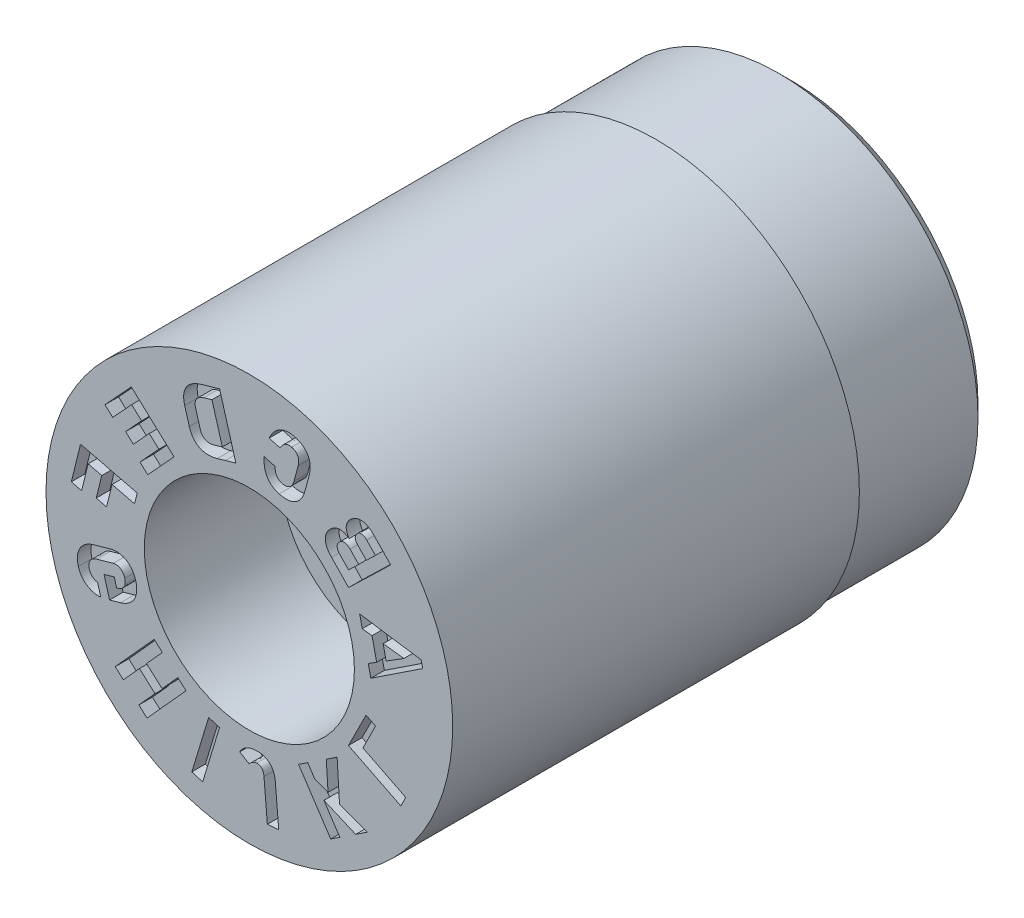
from build123d import *

# Parameters (mm, degrees)
SKETCH4_W          = 2
SKETCH4_H          = 1
CUT_EXTRUDE1_DEPTH = 0.2


with BuildPart() as part:
    # Sketch1 → Revolve1 (revolve)
    with BuildSketch(Plane(origin=(0, 0, 0), x_dir=(0, 0, -1), z_dir=(1, 0, 0)), mode=Mode.PRIVATE) as revolve1_sk:
        Polygon((0, 3), (0, 1.55), (2, 1.55), (2, 0.8), (8, 0.8), (8, 2.75), (7.75, 3), align=None)
    revolve(revolve1_sk.sketch.rotate(Axis((0, 0, 3.797909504), (0, 0, -1)), 90), axis=Axis((0, 0, 3.797909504), (0, 0, -1)))

    # Sketch4 → Cut-Revolve1 (revolve, cut)
    with BuildSketch(Plane(origin=(0, 0, 0), x_dir=(0, 0, -1), z_dir=(1, 0, 0)), mode=Mode.PRIVATE) as cut_revolve1_sk:
        with Locations((7, 3.435)):
            Rectangle(SKETCH4_W, SKETCH4_H)
    revolve(cut_revolve1_sk.sketch.rotate(Axis((0, 0, 0), (0, 0, -1)), 90), axis=Axis((0, 0, 0), (0, 0, -1)), mode=Mode.SUBTRACT)

    # Sketch6 → Cut-Extrude1 (cut)
    # profile 1 of 12: a face of its own
    with BuildSketch(Plane.XY):
        Polygon((2.557112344, 0.51714167), (2.534916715, 0.617228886), (1.627700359, 0.750865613), (1.665534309, 0.581287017), (1.810054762, 0.564113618), (1.878092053, 0.258007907), (1.754401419, 0.181171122), (1.792235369, 0.011592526), align=None)
        Polygon((2.280805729, 0.508174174), (2.018025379, 0.344934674), (1.973629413, 0.544676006), align=None, mode=Mode.SUBTRACT)
    # profile 2 of 12: a face of its own
    with BuildSketch(Plane.XY):
        Polygon((-1.476295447, 1.504463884), (-1.334967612, 1.374509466), (-1.614146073, 1.0709373), (-1.499633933, 0.965694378), (-1.111407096, 1.387815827), (-1.741630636, 1.967321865), (-1.850705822, 1.848743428), (-2.129857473, 1.545200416), (-2.015345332, 1.439957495), (-1.736220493, 1.743471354), (-1.590510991, 1.609487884), (-1.825724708, 1.353724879), (-1.711576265, 1.248627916), align=None)
    # profile 3 of 12: a face of its own
    with BuildSketch(Plane.XY):
        with BuildLine():
            Line((2.085140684, 1.606120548), (1.84036894, 1.859096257))
            add(Edge.make_bspline(
                [(1.84036894, 1.859096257), (1.822115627, 1.877570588), (1.793983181, 1.903334), (1.752110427, 1.929038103), (1.721596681, 1.94324822), (1.691045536, 1.952879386), (1.660522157, 1.957798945), (1.630160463, 1.957469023), (1.60009621, 1.95273834), (1.570694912, 1.943008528), (1.531321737, 1.923647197), (1.504926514, 1.90246375), (1.488476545, 1.886526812)],
                knots=[0, 0, 0, 0, 0.194855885, 0.283381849, 0.366878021, 0.446236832, 0.522449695, 0.597295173, 0.672599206, 0.749380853, 0.828228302, 1, 1, 1, 1], degree=3))
            add(Edge.make_bspline(
                [(1.488476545, 1.886526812), (1.476812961, 1.87557192), (1.461822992, 1.85735973), (1.445963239, 1.830827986), (1.437628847, 1.810324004), (1.43190925, 1.789319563), (1.42906479, 1.76788841), (1.429081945, 1.74602974), (1.4318005, 1.723818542), (1.437672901, 1.701403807), (1.449441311, 1.670760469), (1.461959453, 1.64885337), (1.471649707, 1.634755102)],
                knots=[0, 0, 0, 0, 0.172429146, 0.253445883, 0.332899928, 0.410642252, 0.487984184, 0.565626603, 0.646115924, 0.728966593, 0.815207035, 1, 1, 1, 1], degree=3))
            add(Edge.make_bspline(
                [(1.471649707, 1.634755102), (1.457377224, 1.64593563), (1.434951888, 1.660705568), (1.402779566, 1.674306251), (1.378996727, 1.681184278), (1.355186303, 1.684834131), (1.331493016, 1.685312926), (1.308034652, 1.682573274), (1.284937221, 1.676585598), (1.262202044, 1.667683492), (1.231997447, 1.651000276), (1.211478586, 1.634221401), (1.198520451, 1.62179725)],
                knots=[0, 0, 0, 0, 0.180056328, 0.264446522, 0.345697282, 0.425065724, 0.502740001, 0.58011963, 0.658619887, 0.738834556, 0.821734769, 1, 1, 1, 1], degree=3))
            Line((1.198520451, 1.62179725), (1.197071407, 1.620443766))
            add(Edge.make_bspline(
                [(1.197071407, 1.620443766), (1.18035078, 1.604488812), (1.158351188, 1.578401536), (1.137260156, 1.539486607), (1.126629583, 1.510113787), (1.120894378, 1.480131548), (1.119572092, 1.449645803), (1.123426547, 1.418830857), (1.132015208, 1.387755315), (1.145281, 1.35673308), (1.170156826, 1.314305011), (1.194312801, 1.284877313), (1.212524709, 1.266212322)],
                knots=[0, 0, 0, 0, 0.172258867, 0.251867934, 0.328670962, 0.404017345, 0.478442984, 0.555079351, 0.634372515, 0.717906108, 0.805699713, 1, 1, 1, 1], degree=3))
            Line((1.212524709, 1.266212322), (1.464408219, 1.005804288))
            Line((1.464408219, 1.005804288), (2.085140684, 1.606120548))
        make_face()
        with BuildLine():
            Line((1.613470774, 1.376362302), (1.464056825, 1.231862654))
            Line((1.464056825, 1.231862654), (1.335989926, 1.364238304))
            add(Edge.make_bspline(
                [(1.335989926, 1.364238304), (1.324418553, 1.376190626), (1.309462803, 1.395409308), (1.297994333, 1.424192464), (1.294449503, 1.444836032), (1.295877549, 1.465149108), (1.304266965, 1.492218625), (1.317896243, 1.509551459), (1.328489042, 1.519689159)],
                knots=[0, 0, 0, 0, 0.283532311, 0.406676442, 0.52306497, 0.636270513, 0.749423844, 1, 1, 1, 1], degree=3))
            Line((1.328489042, 1.519689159), (1.329762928, 1.521048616))
            add(Edge.make_bspline(
                [(1.329762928, 1.521048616), (1.337197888, 1.52792447), (1.348696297, 1.537677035), (1.366264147, 1.54593485), (1.379230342, 1.550186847), (1.392434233, 1.552463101), (1.405864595, 1.55221917), (1.419423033, 1.550272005), (1.432970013, 1.54577908), (1.446502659, 1.539462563), (1.465042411, 1.528232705), (1.477338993, 1.516771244), (1.485414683, 1.50872678)],
                knots=[0, 0, 0, 0, 0.172390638, 0.251587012, 0.327309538, 0.402967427, 0.477182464, 0.553868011, 0.634034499, 0.717811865, 0.806397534, 1, 1, 1, 1], degree=3))
            Line((1.485414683, 1.50872678), (1.613470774, 1.376362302))
        make_face(mode=Mode.SUBTRACT)
        with BuildLine():
            Line((1.726088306, 1.485275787), (1.598028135, 1.617644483))
            add(Edge.make_bspline(
                [(1.598028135, 1.617644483), (1.587549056, 1.628495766), (1.574173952, 1.646029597), (1.56400449, 1.672313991), (1.561401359, 1.69137971), (1.563288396, 1.710175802), (1.572025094, 1.73528461), (1.584643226, 1.751600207), (1.594681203, 1.761204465)],
                knots=[0, 0, 0, 0, 0.278252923, 0.399240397, 0.514829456, 0.629035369, 0.743645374, 1, 1, 1, 1], degree=3))
            add(Edge.make_bspline(
                [(1.594681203, 1.761204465), (1.603710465, 1.76987571), (1.619088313, 1.781099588), (1.642880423, 1.786858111), (1.660777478, 1.787212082), (1.678882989, 1.782984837), (1.704386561, 1.77184997), (1.72072342, 1.757078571), (1.731314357, 1.746549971)],
                knots=[0, 0, 0, 0, 0.243286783, 0.354451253, 0.467149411, 0.585039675, 0.70982128, 1, 1, 1, 1], degree=3))
            Line((1.731314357, 1.746549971), (1.859376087, 1.614179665))
            Line((1.859376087, 1.614179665), (1.726088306, 1.485275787))
        make_face(mode=Mode.SUBTRACT)
    # profile 4 of 12: a face of its own
    with BuildSketch(Plane.XY):
        Polygon((-2.025516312, 0.578984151), (-1.693769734, 0.496948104), (-1.654878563, 0.654467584), (-2.49068516, 0.861150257), (-2.626484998, 0.31213847), (-2.474819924, 0.274537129), (-2.378019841, 0.666153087), (-2.177409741, 0.616545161), (-2.258503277, 0.288122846), (-2.106601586, 0.250595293), align=None)
    # profile 5 of 12: a face of its own
    with BuildSketch(Plane.XY):
        Polygon((-1.392079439, -1.777476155), (-1.629894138, -2.040707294), (-1.509832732, -2.149183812), (-0.934198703, -1.512028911), (-1.054260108, -1.403552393), (-1.287519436, -1.661741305), (-1.516312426, -1.45502202), (-1.283118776, -1.196905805), (-1.403180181, -1.088429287), (-1.978814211, -1.725584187), (-1.858752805, -1.834060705), (-1.620872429, -1.57075687), align=None)
    # profile 6 of 12: a face of its own
    with BuildSketch(Plane.XY):
        Polygon((1.160925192, -1.762472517), (0.963728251, -1.687531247), (0.861137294, -1.532446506), (0.726032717, -1.621860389), (1.200156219, -2.338583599), (1.335260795, -2.249169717), (1.100421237, -1.894167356), (1.568886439, -2.094597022), (1.738921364, -1.982129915), (1.330163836, -1.826788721), (1.294974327, -1.245475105), (1.134745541, -1.351444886), align=None)
    # profile 7 of 12: a face of its own
    with BuildSketch(Plane.XY):
        with BuildLine():
            Line((0.821134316, 1.919204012), (0.88202364, 2.146496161))
            add(Edge.make_bspline(
                [(0.88202364, 2.146496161), (0.886135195, 2.162276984), (0.891532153, 2.18573875), (0.895605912, 2.21698057), (0.897748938, 2.239338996), (0.898067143, 2.261132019), (0.897382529, 2.282376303), (0.895156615, 2.302970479), (0.891584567, 2.322975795), (0.886852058, 2.342289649), (0.880647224, 2.360858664), (0.873385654, 2.378761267), (0.864477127, 2.395711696), (0.85459312, 2.412091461), (0.843379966, 2.427616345), (0.830844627, 2.442375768), (0.817142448, 2.456352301), (0.802084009, 2.469439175), (0.786022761, 2.481767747), (0.768721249, 2.493150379), (0.750263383, 2.503566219), (0.730608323, 2.513072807), (0.702380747, 2.524565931), (0.680319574, 2.531832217), (0.665115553, 2.535833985)],
                knots=[0, 0, 0, 0, 0.096646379, 0.142265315, 0.186536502, 0.22958617, 0.27124953, 0.312357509, 0.352139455, 0.391535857, 0.430009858, 0.468003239, 0.505818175, 0.543289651, 0.581231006, 0.619098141, 0.657880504, 0.697033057, 0.737159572, 0.777713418, 0.819580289, 0.862596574, 0.906929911, 1, 1, 1, 1], degree=3))
            add(Edge.make_bspline(
                [(0.665115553, 2.535833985), (0.640270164, 2.542449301), (0.602551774, 2.548476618), (0.552436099, 2.54661362), (0.516613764, 2.540208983), (0.481890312, 2.529657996), (0.448899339, 2.514004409), (0.417397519, 2.49412714), (0.387920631, 2.469354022), (0.360133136, 2.440655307), (0.325548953, 2.395080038), (0.304083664, 2.356693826), (0.29186229, 2.329274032)],
                knots=[0, 0, 0, 0, 0.164608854, 0.24240016, 0.31989715, 0.396879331, 0.473937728, 0.552866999, 0.634604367, 0.719746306, 0.807992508, 1, 1, 1, 1], degree=3))
            Line((0.29186229, 2.329274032), (0.453705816, 2.286103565))
            add(Edge.make_bspline(
                [(0.453705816, 2.286103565), (0.459909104, 2.298318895), (0.470551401, 2.315372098), (0.487108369, 2.335672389), (0.500201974, 2.348488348), (0.513897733, 2.359611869), (0.528171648, 2.368770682), (0.543143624, 2.375708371), (0.558447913, 2.380941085), (0.574239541, 2.383997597), (0.596089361, 2.385360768), (0.61251644, 2.382549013), (0.62331651, 2.379876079)],
                knots=[0, 0, 0, 0, 0.194869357, 0.285089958, 0.372238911, 0.455159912, 0.535866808, 0.612909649, 0.689488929, 0.765520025, 0.841163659, 1, 1, 1, 1], degree=3))
            add(Edge.make_bspline(
                [(0.62331651, 2.379876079), (0.636954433, 2.376348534), (0.656355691, 2.368938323), (0.679044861, 2.354579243), (0.6933228, 2.342296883), (0.705193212, 2.328278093), (0.714907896, 2.312744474), (0.721892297, 2.295414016), (0.726644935, 2.276705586), (0.728917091, 2.256548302), (0.728203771, 2.227141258), (0.724516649, 2.204665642), (0.720180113, 2.189666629)],
                knots=[0, 0, 0, 0, 0.174354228, 0.254683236, 0.331247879, 0.406480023, 0.481199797, 0.556971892, 0.636726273, 0.719433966, 0.807137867, 1, 1, 1, 1], degree=3))
            Line((0.720180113, 2.189666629), (0.65929079, 1.96237448))
            add(Edge.make_bspline(
                [(0.65929079, 1.96237448), (0.655487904, 1.94727109), (0.64753634, 1.926049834), (0.633547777, 1.9002716), (0.621596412, 1.884092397), (0.60817968, 1.870284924), (0.593359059, 1.859062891), (0.577278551, 1.850318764), (0.560027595, 1.844130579), (0.541570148, 1.840618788), (0.514754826, 1.839835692), (0.494274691, 1.842953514), (0.480679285, 1.846682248)],
                knots=[0, 0, 0, 0, 0.19300086, 0.280017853, 0.363208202, 0.441814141, 0.518167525, 0.593026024, 0.668129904, 0.744727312, 0.825193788, 1, 1, 1, 1], degree=3))
            add(Edge.make_bspline(
                [(0.480679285, 1.846682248), (0.46977792, 1.849626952), (0.454027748, 1.855702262), (0.435326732, 1.86755666), (0.422908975, 1.877995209), (0.41201972, 1.889975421), (0.402547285, 1.903415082), (0.394714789, 1.918392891), (0.388392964, 1.934778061), (0.383856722, 1.952566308), (0.379630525, 1.978554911), (0.379746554, 1.998894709), (0.380566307, 2.01266634)],
                knots=[0, 0, 0, 0, 0.159979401, 0.236987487, 0.312610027, 0.38900691, 0.465622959, 0.544808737, 0.627755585, 0.713748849, 0.804319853, 1, 1, 1, 1], degree=3))
            Line((0.380566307, 2.01266634), (0.218722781, 2.055836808))
            add(Edge.make_bspline(
                [(0.218722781, 2.055836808), (0.216403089, 2.026041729), (0.215239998, 1.981967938), (0.223090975, 1.925305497), (0.232452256, 1.886434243), (0.245783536, 1.850458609), (0.262882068, 1.817446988), (0.283669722, 1.787501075), (0.308107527, 1.760746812), (0.336133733, 1.737574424), (0.378345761, 1.710623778), (0.414197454, 1.697201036), (0.438944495, 1.690484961)],
                knots=[0, 0, 0, 0, 0.191703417, 0.28077236, 0.365725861, 0.447316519, 0.525893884, 0.603227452, 0.68014984, 0.757230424, 0.83550786, 1, 1, 1, 1], degree=3))
            add(Edge.make_bspline(
                [(0.438944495, 1.690484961), (0.45416482, 1.686636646), (0.476827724, 1.681379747), (0.507018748, 1.677331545), (0.528742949, 1.675831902), (0.549923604, 1.675507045), (0.570571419, 1.676781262), (0.59071502, 1.679092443), (0.610202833, 1.683084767), (0.62905573, 1.688408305), (0.647240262, 1.694951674), (0.664763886, 1.702728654), (0.681558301, 1.711828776), (0.697531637, 1.722355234), (0.712855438, 1.734053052), (0.727408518, 1.74711987), (0.741367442, 1.761350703), (0.754293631, 1.776983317), (0.766679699, 1.793605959), (0.777777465, 1.811758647), (0.788239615, 1.830912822), (0.797923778, 1.851206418), (0.809760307, 1.88041826), (0.816988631, 1.903403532), (0.821134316, 1.919204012)],
                knots=[0, 0, 0, 0, 0.093040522, 0.137573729, 0.180288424, 0.221965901, 0.262948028, 0.302742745, 0.341969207, 0.380633, 0.418692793, 0.456346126, 0.494091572, 0.531697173, 0.569548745, 0.608176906, 0.647455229, 0.687506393, 0.728242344, 0.770136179, 0.813403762, 0.857486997, 0.903244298, 1, 1, 1, 1], degree=3))
        make_face()
    # profile 8 of 12: a face of its own
    with BuildSketch(Plane.XY):
        with BuildLine():
            Line((-0.438909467, 2.593617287), (-0.712910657, 2.514290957))
            add(Edge.make_bspline(
                [(-0.712910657, 2.514290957), (-0.729634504, 2.509545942), (-0.753869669, 2.501178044), (-0.784916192, 2.488407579), (-0.806444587, 2.478112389), (-0.826686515, 2.466985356), (-0.845651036, 2.455023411), (-0.863301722, 2.442108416), (-0.879835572, 2.428668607), (-0.89487983, 2.414270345), (-0.908738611, 2.399323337), (-0.921186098, 2.383635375), (-0.931993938, 2.367097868), (-0.941563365, 2.350023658), (-0.949926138, 2.332311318), (-0.956750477, 2.313827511), (-0.961998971, 2.294617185), (-0.966068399, 2.274908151), (-0.968783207, 2.254643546), (-0.969556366, 2.233874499), (-0.969513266, 2.212595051), (-0.967730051, 2.190815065), (-0.963203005, 2.160607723), (-0.957860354, 2.137928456), (-0.953507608, 2.122756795)],
                knots=[0, 0, 0, 0, 0.099745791, 0.147048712, 0.192637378, 0.236649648, 0.279574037, 0.321243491, 0.362131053, 0.401788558, 0.440671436, 0.479065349, 0.516588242, 0.55395045, 0.591347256, 0.628907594, 0.666895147, 0.70555323, 0.744368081, 0.784093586, 0.824759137, 0.866460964, 0.909397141, 1, 1, 1, 1], degree=3))
            Line((-0.953507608, 2.122756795), (-0.88555943, 1.888017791))
            add(Edge.make_bspline(
                [(-0.88555943, 1.888017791), (-0.881232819, 1.873600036), (-0.874298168, 1.852374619), (-0.86205511, 1.825736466), (-0.852367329, 1.806948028), (-0.841533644, 1.789348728), (-0.830034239, 1.772562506), (-0.817226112, 1.757129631), (-0.80368406, 1.742535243), (-0.789221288, 1.729136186), (-0.77379643, 1.717003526), (-0.757580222, 1.706091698), (-0.740431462, 1.696519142), (-0.722434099, 1.688179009), (-0.703571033, 1.680928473), (-0.6837069, 1.675360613), (-0.663130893, 1.670656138), (-0.641745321, 1.667390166), (-0.619609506, 1.66562621), (-0.596762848, 1.665351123), (-0.573260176, 1.666588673), (-0.549020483, 1.669236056), (-0.515126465, 1.674639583), (-0.48966971, 1.68114963), (-0.472553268, 1.685910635)],
                knots=[0, 0, 0, 0, 0.086653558, 0.128037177, 0.168492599, 0.208142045, 0.246814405, 0.285402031, 0.323355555, 0.361249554, 0.398651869, 0.436106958, 0.473537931, 0.511467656, 0.550103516, 0.589610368, 0.62999598, 0.671430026, 0.713895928, 0.757599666, 0.802730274, 0.849157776, 0.897771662, 1, 1, 1, 1], degree=3))
            Line((-0.472553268, 1.685910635), (-0.355309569, 1.71992876))
            Line((-0.355309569, 1.71992876), (-0.19909005, 1.765103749))
            Line((-0.19909005, 1.765103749), (-0.438909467, 2.593617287))
        make_face()
        with BuildLine():
            Line((-0.398850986, 1.870353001), (-0.520193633, 1.835181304))
            add(Edge.make_bspline(
                [(-0.520193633, 1.835181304), (-0.532269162, 1.831402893), (-0.550429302, 1.827718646), (-0.574270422, 1.824987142), (-0.590947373, 1.824383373), (-0.606819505, 1.825610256), (-0.622007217, 1.82803323), (-0.636440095, 1.832048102), (-0.650098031, 1.837494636), (-0.662803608, 1.844443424), (-0.674571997, 1.852702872), (-0.685196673, 1.862359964), (-0.69486693, 1.873278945), (-0.703424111, 1.88559686), (-0.713858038, 1.904190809), (-0.719177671, 1.919720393), (-0.72250945, 1.930277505)],
                knots=[0, 0, 0, 0, 0.149232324, 0.218367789, 0.28334483, 0.346008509, 0.40612766, 0.464758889, 0.522600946, 0.579442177, 0.635447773, 0.692041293, 0.748655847, 0.807380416, 0.868897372, 1, 1, 1, 1], degree=3))
            Line((-0.72250945, 1.930277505), (-0.793112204, 2.174122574))
            add(Edge.make_bspline(
                [(-0.793112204, 2.174122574), (-0.796259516, 2.184812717), (-0.799581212, 2.200891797), (-0.800953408, 2.222220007), (-0.800292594, 2.237276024), (-0.797925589, 2.251748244), (-0.794053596, 2.265617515), (-0.788668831, 2.278979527), (-0.781444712, 2.29156451), (-0.772778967, 2.303487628), (-0.762721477, 2.314622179), (-0.751357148, 2.324973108), (-0.738454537, 2.334356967), (-0.724060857, 2.342750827), (-0.702451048, 2.353256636), (-0.685017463, 2.359477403), (-0.672856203, 2.36291343)],
                knots=[0, 0, 0, 0, 0.13139485, 0.192752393, 0.251615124, 0.30870985, 0.365291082, 0.421108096, 0.478123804, 0.535945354, 0.594614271, 0.654753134, 0.716890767, 0.782367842, 0.850987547, 1, 1, 1, 1], degree=3))
            Line((-0.672856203, 2.36291343), (-0.551599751, 2.398060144))
            Line((-0.551599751, 2.398060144), (-0.398850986, 1.870353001))
        make_face(mode=Mode.SUBTRACT)
    # profile 9 of 12: a face of its own
    with BuildSketch(Plane.XY):
        with BuildLine():
            Line((-2.062339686, -0.916002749), (-1.900497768, -0.870180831))
            add(Edge.make_bspline(
                [(-1.900497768, -0.870180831), (-1.885511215, -0.866100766), (-1.863728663, -0.858525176), (-1.835987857, -0.84634204), (-1.816280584, -0.836628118), (-1.797881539, -0.825517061), (-1.780274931, -0.813697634), (-1.76377663, -0.800839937), (-1.748406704, -0.786977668), (-1.734123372, -0.77235605), (-1.720875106, -0.757110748), (-1.709266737, -0.74088918), (-1.698547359, -0.724270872), (-1.689408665, -0.706765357), (-1.681328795, -0.688607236), (-1.674820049, -0.669654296), (-1.669220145, -0.650182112), (-1.66522439, -0.630195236), (-1.662354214, -0.609829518), (-1.661321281, -0.589108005), (-1.661166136, -0.568062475), (-1.662908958, -0.546703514), (-1.6668542, -0.517400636), (-1.671461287, -0.495381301), (-1.675873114, -0.480861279)],
                knots=[0, 0, 0, 0, 0.091968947, 0.136358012, 0.179438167, 0.222009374, 0.263572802, 0.30499914, 0.345794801, 0.386082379, 0.426029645, 0.465295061, 0.504143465, 0.54307809, 0.582146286, 0.621762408, 0.661685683, 0.702080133, 0.742401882, 0.783396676, 0.824885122, 0.866985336, 0.910204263, 1, 1, 1, 1], degree=3))
            add(Edge.make_bspline(
                [(-1.675873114, -0.480861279), (-1.679950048, -0.466185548), (-1.687312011, -0.444837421), (-1.699125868, -0.417572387), (-1.708715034, -0.398263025), (-1.719365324, -0.379994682), (-1.731118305, -0.36276907), (-1.74357358, -0.34642703), (-1.757124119, -0.331277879), (-1.771397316, -0.317182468), (-1.786332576, -0.304206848), (-1.802042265, -0.292640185), (-1.818252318, -0.282063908), (-1.835236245, -0.272845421), (-1.852954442, -0.265042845), (-1.871188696, -0.258201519), (-1.890124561, -0.252924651), (-1.9094939, -0.248828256), (-1.929228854, -0.246129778), (-1.94919972, -0.244634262), (-1.969574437, -0.244849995), (-1.990254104, -0.246050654), (-2.018641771, -0.250050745), (-2.039856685, -0.254696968), (-2.053947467, -0.258764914)],
                knots=[0, 0, 0, 0, 0.092475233, 0.136931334, 0.180392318, 0.223336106, 0.265239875, 0.306969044, 0.348033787, 0.388564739, 0.428736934, 0.468069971, 0.50695237, 0.546206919, 0.585275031, 0.624452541, 0.664381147, 0.704534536, 0.744601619, 0.785268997, 0.826038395, 0.868259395, 0.910984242, 1, 1, 1, 1], degree=3))
            Line((-2.053947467, -0.258764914), (-2.298598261, -0.3279433))
            add(Edge.make_bspline(
                [(-2.298598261, -0.3279433), (-2.31366806, -0.331821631), (-2.335208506, -0.339828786), (-2.36321781, -0.351433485), (-2.382633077, -0.361597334), (-2.401298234, -0.372254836), (-2.418576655, -0.384454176), (-2.435324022, -0.396973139), (-2.450596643, -0.410941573), (-2.464974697, -0.425428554), (-2.477801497, -0.440942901), (-2.489756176, -0.456803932), (-2.500026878, -0.47365792), (-2.50925445, -0.491070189), (-2.517331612, -0.509190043), (-2.523664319, -0.528156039), (-2.52925765, -0.547573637), (-2.5333942, -0.567556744), (-2.53569677, -0.587977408), (-2.537400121, -0.608674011), (-2.536900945, -0.629753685), (-2.535650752, -0.651161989), (-2.531186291, -0.680412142), (-2.526908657, -0.70244333), (-2.522385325, -0.71695131)],
                knots=[0, 0, 0, 0, 0.092066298, 0.136207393, 0.179646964, 0.221921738, 0.263542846, 0.304974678, 0.345811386, 0.386139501, 0.425904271, 0.465079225, 0.503809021, 0.54278282, 0.581890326, 0.621277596, 0.66124104, 0.701676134, 0.742088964, 0.783043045, 0.824688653, 0.866991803, 0.910113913, 1, 1, 1, 1], degree=3))
            add(Edge.make_bspline(
                [(-2.522385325, -0.71695131), (-2.515471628, -0.740764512), (-2.502166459, -0.775443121), (-2.476376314, -0.8170912), (-2.453943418, -0.845311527), (-2.428703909, -0.870714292), (-2.400625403, -0.892494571), (-2.370309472, -0.911047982), (-2.337652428, -0.925799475), (-2.30311027, -0.93692706), (-2.254526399, -0.946403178), (-2.21697037, -0.947463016), (-2.191902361, -0.945381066)],
                knots=[0, 0, 0, 0, 0.17042431, 0.25304691, 0.335431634, 0.417442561, 0.498278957, 0.578817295, 0.660912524, 0.743699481, 0.82742163, 1, 1, 1, 1], degree=3))
            Line((-2.191902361, -0.945381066), (-2.239677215, -0.776711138))
            add(Edge.make_bspline(
                [(-2.239677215, -0.776711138), (-2.249069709, -0.776398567), (-2.262983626, -0.7739983), (-2.280699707, -0.767856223), (-2.293243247, -0.761455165), (-2.305180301, -0.753911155), (-2.316126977, -0.744777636), (-2.326312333, -0.734671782), (-2.344735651, -0.712161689), (-2.355338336, -0.689806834), (-2.360543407, -0.671129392)],
                knots=[0, 0, 0, 0, 0.164045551, 0.245449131, 0.327134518, 0.409874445, 0.491968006, 0.576004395, 0.660561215, 1, 1, 1, 1], degree=3))
            add(Edge.make_bspline(
                [(-2.360543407, -0.671129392), (-2.364327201, -0.65804372), (-2.367694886, -0.638083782), (-2.366936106, -0.61160889), (-2.363637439, -0.592793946), (-2.357825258, -0.574880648), (-2.349261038, -0.558281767), (-2.338740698, -0.542649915), (-2.325478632, -0.528636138), (-2.310150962, -0.516021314), (-2.286404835, -0.501508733), (-2.266589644, -0.493741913), (-2.252776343, -0.489785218)],
                knots=[0, 0, 0, 0, 0.171992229, 0.253427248, 0.33337844, 0.412439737, 0.490252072, 0.56852815, 0.649601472, 0.732965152, 0.818542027, 1, 1, 1, 1], degree=3))
            Line((-2.252776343, -0.489785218), (-2.008125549, -0.420606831))
            add(Edge.make_bspline(
                [(-2.008125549, -0.420606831), (-1.995839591, -0.417320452), (-1.977195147, -0.41386826), (-1.952403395, -0.414981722), (-1.934828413, -0.418419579), (-1.917930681, -0.424066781), (-1.902342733, -0.432529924), (-1.887606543, -0.44283135), (-1.874584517, -0.455907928), (-1.862839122, -0.470923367), (-1.848944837, -0.493985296), (-1.841458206, -0.513226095), (-1.837715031, -0.526683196)],
                knots=[0, 0, 0, 0, 0.169109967, 0.248856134, 0.327834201, 0.406025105, 0.484177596, 0.562330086, 0.643716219, 0.727927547, 0.814727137, 1, 1, 1, 1], degree=3))
            add(Edge.make_bspline(
                [(-1.837715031, -0.526683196), (-1.834311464, -0.540011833), (-1.829972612, -0.56011274), (-1.831091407, -0.586752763), (-1.833793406, -0.605480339), (-1.839296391, -0.623244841), (-1.847281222, -0.639839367), (-1.857921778, -0.655086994), (-1.870799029, -0.669016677), (-1.885958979, -0.681490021), (-1.909792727, -0.696123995), (-1.930008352, -0.703629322), (-1.944012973, -0.707737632)],
                knots=[0, 0, 0, 0, 0.174816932, 0.256335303, 0.335955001, 0.41341519, 0.490444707, 0.56782741, 0.647560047, 0.729545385, 0.815209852, 1, 1, 1, 1], degree=3))
            Line((-1.944012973, -0.707737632), (-1.957668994, -0.711643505))
            Line((-1.957668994, -0.711643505), (-1.993124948, -0.586248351))
            Line((-1.993124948, -0.586248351), (-2.143617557, -0.628765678))
            Line((-2.143617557, -0.628765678), (-2.062339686, -0.916002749))
        make_face()
    # profile 10 of 12: a face of its own
    with BuildSketch(Plane.XY):
        Polygon((-0.439849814, -1.733912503), (-0.599979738, -1.685350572), (-0.848665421, -2.505250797), (-0.688535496, -2.553812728), align=None)
    # profile 11 of 12: a face of its own
    with BuildSketch(Plane.XY):
        with BuildLine():
            Line((-0.141660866, -1.896227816), (-0.000992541, -1.981307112))
            add(Edge.make_bspline(
                [(-0.000992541, -1.981307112), (0.00513243, -1.971881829), (0.01580088, -1.958779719), (0.032749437, -1.944196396), (0.046402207, -1.934773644), (0.060864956, -1.926963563), (0.081025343, -1.918973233), (0.096998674, -1.915845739), (0.107742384, -1.915017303)],
                knots=[0, 0, 0, 0, 0.255779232, 0.38163111, 0.50772149, 0.632579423, 0.754862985, 1, 1, 1, 1], degree=3))
            add(Edge.make_bspline(
                [(0.107742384, -1.915017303), (0.121738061, -1.913895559), (0.143208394, -1.915245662), (0.167904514, -1.928016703), (0.183475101, -1.941456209), (0.196289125, -1.958907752), (0.209992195, -1.988748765), (0.21427592, -2.014319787), (0.215980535, -2.032092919)],
                knots=[0, 0, 0, 0, 0.235651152, 0.344658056, 0.457108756, 0.574857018, 0.7019054, 1, 1, 1, 1], degree=3))
            Line((0.215980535, -2.032092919), (0.265571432, -2.618132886))
            Line((0.265571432, -2.618132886), (0.433476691, -2.604012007))
            Line((0.433476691, -2.604012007), (0.383768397, -2.0172809))
            add(Edge.make_bspline(
                [(0.383768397, -2.0172809), (0.382787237, -2.002910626), (0.379671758, -1.981901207), (0.374267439, -1.954557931), (0.368976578, -1.935341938), (0.362901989, -1.917011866), (0.355796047, -1.899586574), (0.347900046, -1.883029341), (0.338974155, -1.8673884), (0.32921241, -1.852692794), (0.318583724, -1.838992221), (0.306889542, -1.82654482), (0.294650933, -1.814851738), (0.281421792, -1.804264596), (0.267334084, -1.794771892), (0.252490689, -1.786186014), (0.231389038, -1.776154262), (0.202852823, -1.766360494), (0.152326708, -1.756000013), (0.112396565, -1.756112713), (0.085386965, -1.758288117)],
                knots=[0, 0, 0, 0, 0.096055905, 0.141719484, 0.186004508, 0.22903494, 0.270581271, 0.311569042, 0.351425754, 0.39071344, 0.429283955, 0.467041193, 0.504642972, 0.542218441, 0.580013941, 0.617970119, 0.656603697, 0.735861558, 0.818727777, 1, 1, 1, 1], degree=3))
            add(Edge.make_bspline(
                [(0.085386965, -1.758288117), (0.060209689, -1.760163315), (0.023574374, -1.767100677), (-0.022247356, -1.783906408), (-0.053041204, -1.800250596), (-0.080970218, -1.819567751), (-0.11310207, -1.849758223), (-0.132263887, -1.876571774), (-0.141660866, -1.896227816)],
                knots=[0, 0, 0, 0, 0.272312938, 0.400092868, 0.525547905, 0.647707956, 0.765611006, 1, 1, 1, 1], degree=3))
        make_face()
    # profile 12 of 12: a face of its own
    with BuildSketch(Plane.XY):
        Polygon((2.235010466, -1.399282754), (2.307966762, -1.253665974), (1.675857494, -0.937090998), (1.862049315, -0.565333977), (1.7217919, -0.49515372), (1.462649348, -1.0124664), align=None)
    extrude(amount=-CUT_EXTRUDE1_DEPTH, mode=Mode.SUBTRACT)


solid = part.part
